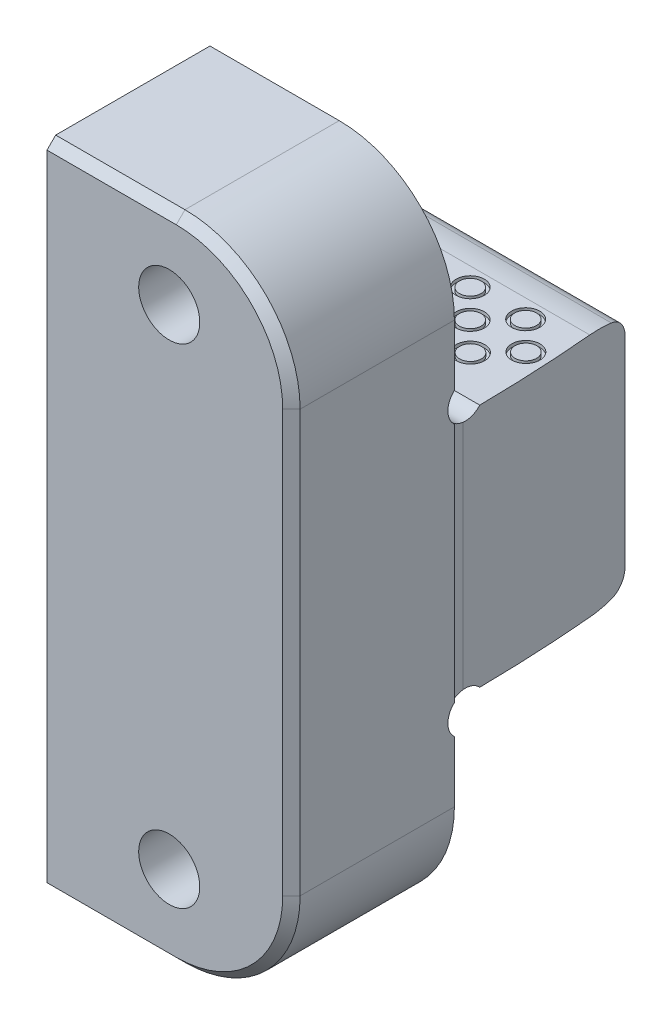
from build123d import *

# Parameters (mm, degrees)
EXTRUDE1_DEPTH             = 14.2875
SKETCH7_W                  = 21.968267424
SKETCH7_H                  = 31.720833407
CUT_EXTRUDE3_DEPTH         = 0.254
SKETCH8_R                  = 2.286
CUT_EXTRUDE4_DEPTH         = 53.185874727
CUT_EXTRUDE5_DEPTH         = 53.185874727
CUT_EXTRUDE6_DEPTH         = 81.410183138
SKETCH15_R                 = 1.651
SKETCH15_R_2               = 1.27
CUT_EXTRUDE7_DEPTH         = 0.381
F_1_4_20_CBORE_D           = 7.14248
F_1_4_20_CBORE_CBORE_D     = 11.1125
F_1_4_20_CBORE_CBORE_DEPTH = 7.14502
FILLET1_R                  = 13.462
CHAMFER1_SIZE              = 1.016


with BuildPart() as part:
    # Sketch3 → Extrude1 (new, symmetric)
    with BuildSketch(Plane(origin=(0, 0, 0), x_dir=(0, 0, -1), z_dir=(1, 0, 0))):
        Polygon((-19.05, -38.1), (0, -38.1), (0, -14.28496), (21.336, -14.28496), (21.336, 14.28496), (0, 14.28496), (0, 38.1), (-19.05, 38.1), align=None)
    extrude(amount=EXTRUDE1_DEPTH, both=True)

    # Sketch7 → Cut-Extrude3 (cut)
    with BuildSketch(Plane(origin=(14.2875, 0, 0), x_dir=(0, 0, -1), z_dir=(1, 0, 0))):
        with Locations((10.984133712, 1.307835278)):
            Rectangle(SKETCH7_W, SKETCH7_H)
    extrude(amount=-CUT_EXTRUDE3_DEPTH, mode=Mode.SUBTRACT)

    # Sketch8 → Cut-Extrude4 (cut, through all)
    with BuildSketch(Plane(origin=(14.2875, 0, 0), x_dir=(0, 0, -1), z_dir=(1, 0, 0))):
        with Locations((1.524, 15.80896)):
            Circle(SKETCH8_R)
        with Locations((1.524, -15.80896)):
            Circle(SKETCH8_R)
    extrude(amount=-CUT_EXTRUDE4_DEPTH, mode=Mode.SUBTRACT)

    # Sketch9 → Cut-Extrude5 (cut, through all)
    with BuildSketch(Plane(origin=(14.2875, 0, 0), x_dir=(0, 0, -1), z_dir=(1, 0, 0))):
        with BuildLine():
            Line((21.336, 11.74496), (23.114, 11.74496))
            Line((23.114, 11.74496), (23.114, 18.09496))
            Line((23.114, 18.09496), (16.764, 18.09496))
            Line((16.764, 18.09496), (16.764, 14.28496))
            ThreePointArc((16.764, 14.28496), (18.166480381, 14.20728343), (19.551804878, 13.975203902))
            ThreePointArc((19.551804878, 13.975203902), (20.835066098, 13.173012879), (21.336, 11.74496))
        make_face()
        with BuildLine():
            Line((23.114, -11.74496), (23.114, -18.09496))
            Line((23.114, -18.09496), (16.764, -18.09496))
            Line((16.764, -18.09496), (16.764, -14.28496))
            ThreePointArc((16.764, -14.28496), (18.166480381, -14.20728343), (19.551804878, -13.975203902))
            ThreePointArc((19.551804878, -13.975203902), (20.835066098, -13.173012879), (21.336, -11.74496))
            Line((21.336, -11.74496), (23.114, -11.74496))
        make_face()
    extrude(amount=-CUT_EXTRUDE5_DEPTH, mode=Mode.SUBTRACT)

    # Sketch13 → Cut-Extrude6 (cut, through all)
    with BuildSketch(Plane(origin=(0, 38.1, 0), x_dir=(1, 0, 0), z_dir=(0, 1, 0))):
        with BuildLine():
            Line((12.209862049, 26.67), (24.909862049, 26.67))
            Line((24.909862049, 26.67), (24.909862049, 1.27))
            Line((24.909862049, 1.27), (14.0335, 1.27))
            ThreePointArc((14.0335, 1.27), (13.577004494, 14.002690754), (12.209862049, 26.67))
        make_face()
    extrude(amount=-CUT_EXTRUDE6_DEPTH, mode=Mode.SUBTRACT)

    # Sketch15 → Cut-Extrude7 (cut)
    # profile 1 of 12: a face of its own
    with BuildSketch(Plane(origin=(0, 14.28496, 0), x_dir=(1, 0, 0), z_dir=(0, 1, 0))):
        with Locations(Location((-4.9403, 14.605, 0), (0, 0, 270))):
            Circle(SKETCH15_R)
        with Locations(Location((-4.9403, 14.605, 0), (0, 0, 270))):
            Circle(SKETCH15_R_2, mode=Mode.SUBTRACT)
    # profile 2 of 12: a face of its own
    with BuildSketch(Plane(origin=(0, 14.28496, 0), x_dir=(1, 0, 0), z_dir=(0, 1, 0))):
        with Locations(Location((1.5367, 14.605, 0), (0, 0, 270))):
            Circle(SKETCH15_R)
        with Locations(Location((1.5367, 14.605, 0), (0, 0, 270))):
            Circle(SKETCH15_R_2, mode=Mode.SUBTRACT)
    # profile 3 of 12: a face of its own
    with BuildSketch(Plane(origin=(0, 14.28496, 0), x_dir=(1, 0, 0), z_dir=(0, 1, 0))):
        with Locations(Location((-11.4173, 14.605, 0), (0, 0, 270))):
            Circle(SKETCH15_R)
        with Locations(Location((-11.4173, 14.605, 0), (0, 0, 270))):
            Circle(SKETCH15_R_2, mode=Mode.SUBTRACT)
    # profile 4 of 12: a face of its own
    with BuildSketch(Plane(origin=(0, 14.28496, 0), x_dir=(1, 0, 0), z_dir=(0, 1, 0))):
        with Locations(Location((8.0137, 14.605, 0), (0, 0, 270))):
            Circle(SKETCH15_R)
        with Locations(Location((8.0137, 14.605, 0), (0, 0, 270))):
            Circle(SKETCH15_R_2, mode=Mode.SUBTRACT)
    # profile 5 of 12: a face of its own
    with BuildSketch(Plane(origin=(0, 14.28496, 0), x_dir=(1, 0, 0), z_dir=(0, 1, 0))):
        with Locations(Location((-1.6637, 11.303, 0), (0, 0, 270))):
            Circle(SKETCH15_R)
        with Locations(Location((-1.6637, 11.303, 0), (0, 0, 270))):
            Circle(SKETCH15_R_2, mode=Mode.SUBTRACT)
    # profile 6 of 12: a face of its own
    with BuildSketch(Plane(origin=(0, 14.28496, 0), x_dir=(1, 0, 0), z_dir=(0, 1, 0))):
        with Locations(Location((4.8387, 11.303, 0), (0, 0, 270))):
            Circle(SKETCH15_R)
        with Locations(Location((4.8387, 11.303, 0), (0, 0, 270))):
            Circle(SKETCH15_R_2, mode=Mode.SUBTRACT)
    # profile 7 of 12: a face of its own
    with BuildSketch(Plane(origin=(0, 14.28496, 0), x_dir=(1, 0, 0), z_dir=(0, 1, 0))):
        with Locations(Location((-8.1661, 11.303, 0), (0, 0, 270))):
            Circle(SKETCH15_R)
        with Locations(Location((-8.1661, 11.303, 0), (0, 0, 270))):
            Circle(SKETCH15_R_2, mode=Mode.SUBTRACT)
    # profile 8 of 12: a face of its own
    with BuildSketch(Plane(origin=(0, 14.28496, 0), x_dir=(1, 0, 0), z_dir=(0, 1, 0))):
        with Locations(Location((11.3411, 11.303, 0), (0, 0, 270))):
            Circle(SKETCH15_R)
        with Locations(Location((11.3411, 11.303, 0), (0, 0, 270))):
            Circle(SKETCH15_R_2, mode=Mode.SUBTRACT)
    # profile 9 of 12: a face of its own
    with BuildSketch(Plane(origin=(0, 14.28496, 0), x_dir=(1, 0, 0), z_dir=(0, 1, 0))):
        with Locations(Location((-4.8895, 8.001, 0), (0, 0, 270))):
            Circle(SKETCH15_R)
        with Locations(Location((-4.8895, 8.001, 0), (0, 0, 270))):
            Circle(SKETCH15_R_2, mode=Mode.SUBTRACT)
    # profile 10 of 12: a face of its own
    with BuildSketch(Plane(origin=(0, 14.28496, 0), x_dir=(1, 0, 0), z_dir=(0, 1, 0))):
        with Locations(Location((1.6383, 8.001, 0), (0, 0, 270))):
            Circle(SKETCH15_R)
        with Locations(Location((1.6383, 8.001, 0), (0, 0, 270))):
            Circle(SKETCH15_R_2, mode=Mode.SUBTRACT)
    # profile 11 of 12: a face of its own
    with BuildSketch(Plane(origin=(0, 14.28496, 0), x_dir=(1, 0, 0), z_dir=(0, 1, 0))):
        with Locations(Location((-11.4173, 8.001, 0), (0, 0, 270))):
            Circle(SKETCH15_R)
        with Locations(Location((-11.4173, 8.001, 0), (0, 0, 270))):
            Circle(SKETCH15_R_2, mode=Mode.SUBTRACT)
    # profile 12 of 12: a face of its own
    with BuildSketch(Plane(origin=(0, 14.28496, 0), x_dir=(1, 0, 0), z_dir=(0, 1, 0))):
        with Locations(Location((8.1661, 8.001, 0), (0, 0, 270))):
            Circle(SKETCH15_R)
        with Locations(Location((8.1661, 8.001, 0), (0, 0, 270))):
            Circle(SKETCH15_R_2, mode=Mode.SUBTRACT)
    cut_extrude7 = extrude(amount=-CUT_EXTRUDE7_DEPTH, mode=Mode.SUBTRACT)

    # Mirror1: Cut-Extrude7 across plane
    add(cut_extrude7.mirror(Plane.ZX), mode=Mode.SUBTRACT)

    # 1_4_-20 CBORE (through all)
    with Locations(Plane(origin=(0, 0, 0), x_dir=(-1, 0, 0), z_dir=(0, 0, -1))):
        with Locations((0, 28.575), (0, -28.575)):
            CounterBoreHole(F_1_4_20_CBORE_D / 2, F_1_4_20_CBORE_CBORE_D / 2, F_1_4_20_CBORE_CBORE_DEPTH)

    # Fillet1
    fillet1_edges = [part.edges().sort_by_distance(p)[0] for p in [
        (14.2875, 38.1, 9.525),
        (14.2875, -38.1, 9.525),
    ]]
    fillet(fillet1_edges, radius=FILLET1_R)

    # Chamfer1
    chamfer1_edges = [part.edges().sort_by_distance(p)[0] for p in [
        (14.2875, 0, 19.05),
        (-6.731, -38.1, 19.05),
        (-6.731, 38.1, 19.05),
        (10.344571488, 34.157071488, 19.05),
        (10.344571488, -34.157071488, 19.05),
    ]]
    chamfer(chamfer1_edges, length=CHAMFER1_SIZE)


solid = part.part
